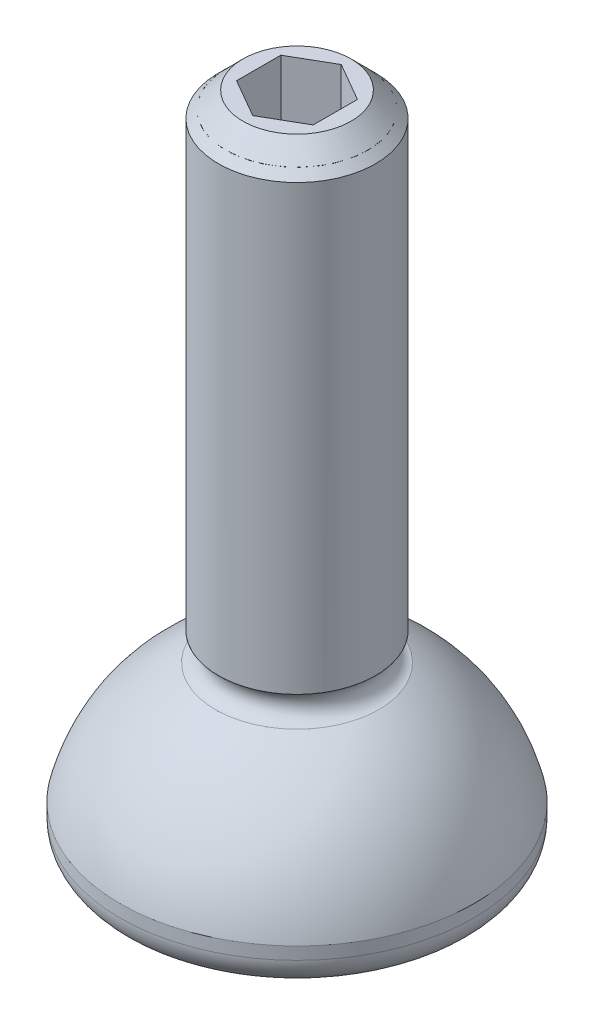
ISO-10303-21;
HEADER;
FILE_DESCRIPTION(('STEP AP214'),'2;1');
FILE_NAME('part.step','',(''),(''),'','','');
FILE_SCHEMA(('AUTOMOTIVE_DESIGN { 1 0 10303 214 1 1 1 1 }'));
ENDSEC;
DATA;
#1=APPLICATION_CONTEXT('core data for automotive mechanical design processes');
#2=APPLICATION_PROTOCOL_DEFINITION('international standard','automotive_design',2000,#1);
#3=PRODUCT_CONTEXT('',#1,'mechanical');
#4=PRODUCT('Part','Part','',(#3));
#5=PRODUCT_RELATED_PRODUCT_CATEGORY('part','',(#4));
#6=PRODUCT_DEFINITION_FORMATION('','',#4);
#7=PRODUCT_DEFINITION_CONTEXT('part definition',#1,'design');
#8=PRODUCT_DEFINITION('design','',#6,#7);
#9=PRODUCT_DEFINITION_SHAPE('','',#8);
#10=(LENGTH_UNIT() NAMED_UNIT(*) SI_UNIT(.MILLI.,.METRE.));
#11=(NAMED_UNIT(*) PLANE_ANGLE_UNIT() SI_UNIT($,.RADIAN.));
#12=(NAMED_UNIT(*) SI_UNIT($,.STERADIAN.) SOLID_ANGLE_UNIT());
#13=UNCERTAINTY_MEASURE_WITH_UNIT(LENGTH_MEASURE(1.E-05),#10,'distance_accuracy_value','');
#14=(GEOMETRIC_REPRESENTATION_CONTEXT(3) GLOBAL_UNCERTAINTY_ASSIGNED_CONTEXT((#13)) GLOBAL_UNIT_ASSIGNED_CONTEXT((#10,
#11,#12)) REPRESENTATION_CONTEXT('',''));
#15=CARTESIAN_POINT('',(0.,0.,0.));
#16=DIRECTION('',(0.,0.,1.));
#17=DIRECTION('',(1.,0.,0.));
#18=AXIS2_PLACEMENT_3D('',#15,#16,#17);
#19=CARTESIAN_POINT('',(0.,18.719800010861,0.));
#20=DIRECTION('',(0.,-1.,0.));
#21=DIRECTION('',(0.,0.,-1.));
#22=AXIS2_PLACEMENT_3D('',#19,#20,#21);
#23=CYLINDRICAL_SURFACE('',#22,1.8288);
#24=CARTESIAN_POINT('',(0.,4.92119226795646,0.));
#25=DIRECTION('',(0.,-1.,0.));
#26=DIRECTION('',(0.,0.,-1.));
#27=AXIS2_PLACEMENT_3D('',#24,#25,#26);
#28=CIRCLE('',#27,1.8288);
#29=CARTESIAN_POINT('',(0.,4.92119226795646,-1.8288));
#30=VERTEX_POINT('',#29);
#31=EDGE_CURVE('P0_E21',#30,#30,#28,.F.);
#32=ORIENTED_EDGE('',*,*,#31,.T.);
#33=EDGE_LOOP('',(#32));
#34=FACE_BOUND('',#33,.T.);
#35=CARTESIAN_POINT('',(0.,16.5862,0.));
#36=DIRECTION('',(0.,-1.,0.));
#37=DIRECTION('',(0.,0.,-1.));
#38=AXIS2_PLACEMENT_3D('',#35,#36,#37);
#39=CIRCLE('',#38,1.8288);
#40=CARTESIAN_POINT('',(0.,16.5862,-1.8288));
#41=VERTEX_POINT('',#40);
#42=EDGE_CURVE('P0_E11',#41,#41,#39,.T.);
#43=ORIENTED_EDGE('',*,*,#42,.T.);
#44=EDGE_LOOP('',(#43));
#45=FACE_BOUND('',#44,.T.);
#46=ADVANCED_FACE('P0_F17',(#34,#45),#23,.T.);
#47=CARTESIAN_POINT('',(0.,4.92119226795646,0.));
#48=DIRECTION('',(0.,-1.,0.));
#49=DIRECTION('',(0.,0.,-1.));
#50=AXIS2_PLACEMENT_3D('',#47,#48,#49);
#51=PLANE('',#50);
#52=ORIENTED_EDGE('',*,*,#31,.F.);
#53=EDGE_LOOP('',(#52));
#54=FACE_BOUND('',#53,.T.);
#55=CARTESIAN_POINT('',(2.032,4.92119226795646,0.));
#56=CARTESIAN_POINT('',(2.03179753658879,4.92119226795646,0.387835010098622));
#57=CARTESIAN_POINT('',(1.88932982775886,4.92119226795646,0.747968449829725));
#58=CARTESIAN_POINT('',(1.73471410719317,4.92119226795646,1.13880993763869));
#59=CARTESIAN_POINT('',(1.43684097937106,4.92119226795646,1.43684097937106));
#60=CARTESIAN_POINT('',(1.13971284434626,4.92119226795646,1.73412663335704));
#61=CARTESIAN_POINT('',(0.747968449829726,4.92119226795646,1.88932982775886));
#62=CARTESIAN_POINT('',(0.38811403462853,4.92119226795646,2.03189869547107));
#63=CARTESIAN_POINT('',(0.,4.92119226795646,2.032));
#64=CARTESIAN_POINT('',(-0.387067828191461,4.92119226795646,2.03210103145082));
#65=CARTESIAN_POINT('',(-0.747968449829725,4.92119226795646,1.88932982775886));
#66=CARTESIAN_POINT('',(-1.13880993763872,4.92119226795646,1.73471410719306));
#67=CARTESIAN_POINT('',(-1.43684097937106,4.92119226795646,1.43684097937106));
#68=CARTESIAN_POINT('',(-1.73412663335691,4.92119226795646,1.13971284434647));
#69=CARTESIAN_POINT('',(-1.88932982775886,4.92119226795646,0.747968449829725));
#70=CARTESIAN_POINT('',(-2.0317972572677,4.92119226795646,0.388370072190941));
#71=CARTESIAN_POINT('',(-2.032,4.92119226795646,0.));
#72=B_SPLINE_CURVE_WITH_KNOTS('',2,(#55,#56,#57,#58,#59,#60,#61,#62,#63,#64,#65,#66,#67,#68,#69,
#70,#71),.UNSPECIFIED.,.F.,.F.,(3,2,2,2,2,2,2,2,3),(0.,0.125,0.25,0.375,0.5,0.625,0.75,0.875,
1.),.UNSPECIFIED.);
#73=CARTESIAN_POINT('',(2.032,4.92119226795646,0.));
#74=VERTEX_POINT('',#73);
#75=CARTESIAN_POINT('',(-2.032,4.92119226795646,0.));
#76=VERTEX_POINT('',#75);
#77=EDGE_CURVE('P0_E29',#74,#76,#72,.T.);
#78=ORIENTED_EDGE('',*,*,#77,.F.);
#79=CARTESIAN_POINT('',(-2.032,4.92119226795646,0.));
#80=CARTESIAN_POINT('',(-2.03179753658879,4.92119226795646,-0.387835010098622));
#81=CARTESIAN_POINT('',(-1.88932982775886,4.92119226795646,-0.747968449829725));
#82=CARTESIAN_POINT('',(-1.73471410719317,4.92119226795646,-1.13880993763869));
#83=CARTESIAN_POINT('',(-1.43684097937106,4.92119226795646,-1.43684097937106));
#84=CARTESIAN_POINT('',(-1.13971284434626,4.92119226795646,-1.73412663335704));
#85=CARTESIAN_POINT('',(-0.747968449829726,4.92119226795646,-1.88932982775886));
#86=CARTESIAN_POINT('',(-0.38811403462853,4.92119226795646,-2.03189869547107));
#87=CARTESIAN_POINT('',(0.,4.92119226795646,-2.032));
#88=CARTESIAN_POINT('',(0.387067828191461,4.92119226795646,-2.03210103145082));
#89=CARTESIAN_POINT('',(0.747968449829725,4.92119226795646,-1.88932982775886));
#90=CARTESIAN_POINT('',(1.13880993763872,4.92119226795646,-1.73471410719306));
#91=CARTESIAN_POINT('',(1.43684097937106,4.92119226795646,-1.43684097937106));
#92=CARTESIAN_POINT('',(1.73412663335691,4.92119226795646,-1.13971284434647));
#93=CARTESIAN_POINT('',(1.88932982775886,4.92119226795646,-0.747968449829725));
#94=CARTESIAN_POINT('',(2.0317972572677,4.92119226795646,-0.388370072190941));
#95=CARTESIAN_POINT('',(2.032,4.92119226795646,0.));
#96=B_SPLINE_CURVE_WITH_KNOTS('',2,(#79,#80,#81,#82,#83,#84,#85,#86,#87,#88,#89,#90,#91,#92,#93,
#94,#95),.UNSPECIFIED.,.F.,.F.,(3,2,2,2,2,2,2,2,3),(0.,0.125,0.25,0.375,0.5,0.625,0.75,0.875,
1.),.UNSPECIFIED.);
#97=EDGE_CURVE('P0_E33',#76,#74,#96,.T.);
#98=ORIENTED_EDGE('',*,*,#97,.F.);
#99=EDGE_LOOP('',(#78,#98));
#100=FACE_BOUND('',#99,.T.);
#101=ADVANCED_FACE('P0_F18',(#54,#100),#51,.F.);
#102=OPEN_SHELL('',(#46,#101));
#103=SHELL_BASED_SURFACE_MODEL('P0_B1',(#102));
#104=CARTESIAN_POINT('',(0.,13.7159999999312,0.));
#105=DIRECTION('',(0.,1.,0.));
#106=DIRECTION('',(0.,0.,1.));
#107=AXIS2_PLACEMENT_3D('',#104,#105,#106);
#108=CONICAL_SURFACE('',#107,0.990599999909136,1.02974425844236);
#109=CARTESIAN_POINT('',(5.6843418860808E-11,13.1207874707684,0.));
#110=VERTEX_POINT('',#109);
#111=VERTEX_LOOP('',#110);
#112=FACE_BOUND('',#111,.T.);
#113=CARTESIAN_POINT('',(0.,13.716,0.));
#114=DIRECTION('',(0.,1.,0.));
#115=DIRECTION('',(0.,0.,1.));
#116=AXIS2_PLACEMENT_3D('',#113,#114,#115);
#117=CIRCLE('',#116,0.9906);
#118=CARTESIAN_POINT('',(0.,13.716,0.9906));
#119=VERTEX_POINT('',#118);
#120=EDGE_CURVE('P1_E133',#119,#119,#117,.T.);
#121=ORIENTED_EDGE('',*,*,#120,.T.);
#122=EDGE_LOOP('',(#121));
#123=FACE_BOUND('',#122,.T.);
#124=ADVANCED_FACE('P1_F17',(#112,#123),#108,.F.);
#125=CARTESIAN_POINT('',(0.,12.9259268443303,0.));
#126=DIRECTION('',(0.,1.,0.));
#127=DIRECTION('',(0.,0.,1.));
#128=AXIS2_PLACEMENT_3D('',#125,#126,#127);
#129=CYLINDRICAL_SURFACE('',#128,0.9906);
#130=ORIENTED_EDGE('',*,*,#120,.F.);
#131=EDGE_LOOP('',(#130));
#132=FACE_BOUND('',#131,.T.);
#133=CARTESIAN_POINT('',(0.,14.986,0.));
#134=DIRECTION('',(0.,1.,0.));
#135=DIRECTION('',(0.,0.,1.));
#136=AXIS2_PLACEMENT_3D('',#133,#134,#135);
#137=CIRCLE('',#136,0.9906);
#138=CARTESIAN_POINT('',(0.9906,14.986,0.));
#139=VERTEX_POINT('',#138);
#140=CARTESIAN_POINT('',(0.495300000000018,14.986,0.857884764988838));
#141=VERTEX_POINT('',#140);
#142=EDGE_CURVE('P1_E123',#139,#141,#137,.F.);
#143=ORIENTED_EDGE('',*,*,#142,.F.);
#144=CARTESIAN_POINT('',(0.,14.986,0.));
#145=DIRECTION('',(0.,1.,0.));
#146=DIRECTION('',(0.,0.,1.));
#147=AXIS2_PLACEMENT_3D('',#144,#145,#146);
#148=CIRCLE('',#147,0.9906);
#149=CARTESIAN_POINT('',(0.495300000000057,14.986,-0.857884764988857));
#150=VERTEX_POINT('',#149);
#151=EDGE_CURVE('P1_E100',#150,#139,#148,.F.);
#152=ORIENTED_EDGE('',*,*,#151,.F.);
#153=CARTESIAN_POINT('',(0.,14.986,0.));
#154=DIRECTION('',(0.,1.,0.));
#155=DIRECTION('',(0.,0.,1.));
#156=AXIS2_PLACEMENT_3D('',#153,#154,#155);
#157=CIRCLE('',#156,0.9906);
#158=CARTESIAN_POINT('',(-0.495300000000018,14.986,-0.857884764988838));
#159=VERTEX_POINT('',#158);
#160=EDGE_CURVE('P1_E93',#159,#150,#157,.F.);
#161=ORIENTED_EDGE('',*,*,#160,.F.);
#162=CARTESIAN_POINT('',(0.,14.986,0.));
#163=DIRECTION('',(0.,1.,0.));
#164=DIRECTION('',(0.,0.,1.));
#165=AXIS2_PLACEMENT_3D('',#162,#163,#164);
#166=CIRCLE('',#165,0.9906);
#167=CARTESIAN_POINT('',(-0.9906,14.986,0.));
#168=VERTEX_POINT('',#167);
#169=EDGE_CURVE('P1_E108',#168,#159,#166,.F.);
#170=ORIENTED_EDGE('',*,*,#169,.F.);
#171=CARTESIAN_POINT('',(0.,14.986,0.));
#172=DIRECTION('',(0.,1.,0.));
#173=DIRECTION('',(0.,0.,1.));
#174=AXIS2_PLACEMENT_3D('',#171,#172,#173);
#175=CIRCLE('',#174,0.9906);
#176=CARTESIAN_POINT('',(-0.495300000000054,14.986,0.857884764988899));
#177=VERTEX_POINT('',#176);
#178=EDGE_CURVE('P1_E138',#177,#168,#175,.F.);
#179=ORIENTED_EDGE('',*,*,#178,.F.);
#180=CARTESIAN_POINT('',(0.,14.986,0.));
#181=DIRECTION('',(0.,1.,0.));
#182=DIRECTION('',(0.,0.,1.));
#183=AXIS2_PLACEMENT_3D('',#180,#181,#182);
#184=CIRCLE('',#183,0.9906);
#185=EDGE_CURVE('P1_E131',#141,#177,#184,.F.);
#186=ORIENTED_EDGE('',*,*,#185,.F.);
#187=EDGE_LOOP('',(#143,#152,#161,#170,#179,#186));
#188=FACE_BOUND('',#187,.T.);
#189=ADVANCED_FACE('P1_F129',(#132,#188),#129,.F.);
#190=CARTESIAN_POINT('',(0.,14.986,0.));
#191=DIRECTION('',(0.,1.,0.));
#192=DIRECTION('',(0.,0.,1.));
#193=AXIS2_PLACEMENT_3D('',#190,#191,#192);
#194=PLANE('',#193);
#195=DIRECTION('',(0.,0.,-1.));
#196=VECTOR('',#195,1.);
#197=CARTESIAN_POINT('',(0.9906,14.986,0.57192317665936));
#198=LINE('',#197,#196);
#199=CARTESIAN_POINT('',(0.990599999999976,14.986,0.571923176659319));
#200=VERTEX_POINT('',#199);
#201=EDGE_CURVE('P1_E115',#200,#139,#198,.T.);
#202=ORIENTED_EDGE('',*,*,#201,.T.);
#203=ORIENTED_EDGE('',*,*,#142,.T.);
#204=DIRECTION('',(0.866025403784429,0.,-0.500000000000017));
#205=VECTOR('',#204,1.);
#206=CARTESIAN_POINT('',(0.,14.986,1.14384635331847));
#207=LINE('',#206,#205);
#208=EDGE_CURVE('P1_E125',#141,#200,#207,.T.);
#209=ORIENTED_EDGE('',*,*,#208,.T.);
#210=EDGE_LOOP('',(#202,#203,#209));
#211=FACE_BOUND('',#210,.T.);
#212=ADVANCED_FACE('P1_F122',(#211),#194,.T.);
#213=CARTESIAN_POINT('',(0.,14.986,0.));
#214=DIRECTION('',(0.,1.,0.));
#215=DIRECTION('',(0.,0.,1.));
#216=AXIS2_PLACEMENT_3D('',#213,#214,#215);
#217=PLANE('',#216);
#218=DIRECTION('',(0.866025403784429,0.,-0.500000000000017));
#219=VECTOR('',#218,1.);
#220=CARTESIAN_POINT('',(0.,14.986,1.14384635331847));
#221=LINE('',#220,#219);
#222=CARTESIAN_POINT('',(0.,14.986,1.14384635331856));
#223=VERTEX_POINT('',#222);
#224=EDGE_CURVE('P1_E311',#223,#141,#221,.T.);
#225=ORIENTED_EDGE('',*,*,#224,.T.);
#226=ORIENTED_EDGE('',*,*,#185,.T.);
#227=DIRECTION('',(0.866025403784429,0.,0.500000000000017));
#228=VECTOR('',#227,1.);
#229=CARTESIAN_POINT('',(-0.9906,14.986,0.57192317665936));
#230=LINE('',#229,#228);
#231=EDGE_CURVE('P1_E325',#177,#223,#230,.T.);
#232=ORIENTED_EDGE('',*,*,#231,.T.);
#233=EDGE_LOOP('',(#225,#226,#232));
#234=FACE_BOUND('',#233,.T.);
#235=ADVANCED_FACE('P1_F194',(#234),#217,.T.);
#236=CARTESIAN_POINT('',(0.,17.018,1.14384635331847));
#237=DIRECTION('',(0.500000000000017,0.,0.866025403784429));
#238=DIRECTION('',(0.866025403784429,0.,-0.500000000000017));
#239=AXIS2_PLACEMENT_3D('',#236,#237,#238);
#240=PLANE('',#239);
#241=ORIENTED_EDGE('',*,*,#208,.F.);
#242=ORIENTED_EDGE('',*,*,#224,.F.);
#243=DIRECTION('',(0.,1.,0.));
#244=VECTOR('',#243,1.);
#245=CARTESIAN_POINT('',(0.,17.018,1.14384635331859));
#246=LINE('',#245,#244);
#247=CARTESIAN_POINT('',(0.,17.018,1.14384635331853));
#248=VERTEX_POINT('',#247);
#249=EDGE_CURVE('P1_E154',#223,#248,#246,.T.);
#250=ORIENTED_EDGE('',*,*,#249,.T.);
#251=DIRECTION('',(0.866025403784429,0.,-0.500000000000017));
#252=VECTOR('',#251,1.);
#253=CARTESIAN_POINT('',(0.,17.018,1.14384635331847));
#254=LINE('',#253,#252);
#255=CARTESIAN_POINT('',(0.990599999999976,17.018,0.571923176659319));
#256=VERTEX_POINT('',#255);
#257=EDGE_CURVE('P1_E135',#256,#248,#254,.F.);
#258=ORIENTED_EDGE('',*,*,#257,.F.);
#259=DIRECTION('',(0.,1.,0.));
#260=VECTOR('',#259,1.);
#261=CARTESIAN_POINT('',(0.9906,17.018,0.57192317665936));
#262=LINE('',#261,#260);
#263=EDGE_CURVE('P1_E127',#256,#200,#262,.F.);
#264=ORIENTED_EDGE('',*,*,#263,.T.);
#265=EDGE_LOOP('',(#241,#242,#250,#258,#264));
#266=FACE_BOUND('',#265,.T.);
#267=ADVANCED_FACE('P1_F191',(#266),#240,.F.);
#268=CARTESIAN_POINT('',(0.9906,17.018,0.57192317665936));
#269=DIRECTION('',(1.,0.,0.));
#270=DIRECTION('',(0.,0.,-1.));
#271=AXIS2_PLACEMENT_3D('',#268,#269,#270);
#272=PLANE('',#271);
#273=DIRECTION('',(0.,0.,1.));
#274=VECTOR('',#273,1.);
#275=CARTESIAN_POINT('',(0.9906,14.986,0.));
#276=LINE('',#275,#274);
#277=CARTESIAN_POINT('',(0.9906,14.986,-0.57192317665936));
#278=VERTEX_POINT('',#277);
#279=EDGE_CURVE('P1_E103',#139,#278,#276,.F.);
#280=ORIENTED_EDGE('',*,*,#279,.F.);
#281=ORIENTED_EDGE('',*,*,#201,.F.);
#282=ORIENTED_EDGE('',*,*,#263,.F.);
#283=DIRECTION('',(0.,0.,-1.));
#284=VECTOR('',#283,1.);
#285=CARTESIAN_POINT('',(0.9906,17.018,0.57192317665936));
#286=LINE('',#285,#284);
#287=CARTESIAN_POINT('',(0.9906,17.018,-0.57192317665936));
#288=VERTEX_POINT('',#287);
#289=EDGE_CURVE('P1_E315',#288,#256,#286,.F.);
#290=ORIENTED_EDGE('',*,*,#289,.F.);
#291=DIRECTION('',(0.,1.,0.));
#292=VECTOR('',#291,1.);
#293=CARTESIAN_POINT('',(0.9906,17.018,-0.57192317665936));
#294=LINE('',#293,#292);
#295=EDGE_CURVE('P1_E117',#288,#278,#294,.F.);
#296=ORIENTED_EDGE('',*,*,#295,.T.);
#297=EDGE_LOOP('',(#280,#281,#282,#290,#296));
#298=FACE_BOUND('',#297,.T.);
#299=ADVANCED_FACE('P1_F113',(#298),#272,.F.);
#300=CARTESIAN_POINT('',(0.,14.986,0.));
#301=DIRECTION('',(0.,1.,0.));
#302=DIRECTION('',(0.,0.,1.));
#303=AXIS2_PLACEMENT_3D('',#300,#301,#302);
#304=PLANE('',#303);
#305=DIRECTION('',(-0.866025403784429,0.,-0.500000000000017));
#306=VECTOR('',#305,1.);
#307=CARTESIAN_POINT('',(0.9906,14.986,-0.57192317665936));
#308=LINE('',#307,#306);
#309=EDGE_CURVE('P1_E105',#278,#150,#308,.T.);
#310=ORIENTED_EDGE('',*,*,#309,.T.);
#311=ORIENTED_EDGE('',*,*,#151,.T.);
#312=ORIENTED_EDGE('',*,*,#279,.T.);
#313=EDGE_LOOP('',(#310,#311,#312));
#314=FACE_BOUND('',#313,.T.);
#315=ADVANCED_FACE('P1_F102',(#314),#304,.T.);
#316=CARTESIAN_POINT('',(0.,14.986,0.));
#317=DIRECTION('',(0.,1.,0.));
#318=DIRECTION('',(0.,0.,1.));
#319=AXIS2_PLACEMENT_3D('',#316,#317,#318);
#320=PLANE('',#319);
#321=DIRECTION('',(0.866025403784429,0.,0.500000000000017));
#322=VECTOR('',#321,1.);
#323=CARTESIAN_POINT('',(-0.9906,14.986,0.57192317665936));
#324=LINE('',#323,#322);
#325=CARTESIAN_POINT('',(-0.9906,14.986,0.57192317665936));
#326=VERTEX_POINT('',#325);
#327=EDGE_CURVE('P1_E307',#326,#177,#324,.T.);
#328=ORIENTED_EDGE('',*,*,#327,.T.);
#329=ORIENTED_EDGE('',*,*,#178,.T.);
#330=DIRECTION('',(0.,0.,1.));
#331=VECTOR('',#330,1.);
#332=CARTESIAN_POINT('',(-0.9906,14.986,-0.57192317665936));
#333=LINE('',#332,#331);
#334=EDGE_CURVE('P1_E272',#168,#326,#333,.T.);
#335=ORIENTED_EDGE('',*,*,#334,.T.);
#336=EDGE_LOOP('',(#328,#329,#335));
#337=FACE_BOUND('',#336,.T.);
#338=ADVANCED_FACE('P1_F182',(#337),#320,.T.);
#339=CARTESIAN_POINT('',(-0.9906,17.018,0.57192317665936));
#340=DIRECTION('',(-0.500000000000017,0.,0.866025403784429));
#341=DIRECTION('',(0.866025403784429,0.,0.500000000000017));
#342=AXIS2_PLACEMENT_3D('',#339,#340,#341);
#343=PLANE('',#342);
#344=ORIENTED_EDGE('',*,*,#231,.F.);
#345=ORIENTED_EDGE('',*,*,#327,.F.);
#346=DIRECTION('',(0.,1.,0.));
#347=VECTOR('',#346,1.);
#348=CARTESIAN_POINT('',(-0.9906,17.018,0.57192317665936));
#349=LINE('',#348,#347);
#350=CARTESIAN_POINT('',(-0.9906,17.018,0.57192317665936));
#351=VERTEX_POINT('',#350);
#352=EDGE_CURVE('P1_E158',#326,#351,#349,.T.);
#353=ORIENTED_EDGE('',*,*,#352,.T.);
#354=DIRECTION('',(0.866025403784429,0.,0.500000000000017));
#355=VECTOR('',#354,1.);
#356=CARTESIAN_POINT('',(-0.9906,17.018,0.57192317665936));
#357=LINE('',#356,#355);
#358=EDGE_CURVE('P1_E118',#248,#351,#357,.F.);
#359=ORIENTED_EDGE('',*,*,#358,.F.);
#360=ORIENTED_EDGE('',*,*,#249,.F.);
#361=EDGE_LOOP('',(#344,#345,#353,#359,#360));
#362=FACE_BOUND('',#361,.T.);
#363=ADVANCED_FACE('P1_F177',(#362),#343,.F.);
#364=CARTESIAN_POINT('',(0.,0.,0.));
#365=DIRECTION('',(0.,-1.,0.));
#366=DIRECTION('',(0.,0.,-1.));
#367=AXIS2_PLACEMENT_3D('',#364,#365,#366);
#368=PLANE('',#367);
#369=CARTESIAN_POINT('',(-3.81,0.,0.));
#370=CARTESIAN_POINT('',(-3.80998123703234,3.42991093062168E-09,0.073703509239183));
#371=CARTESIAN_POINT('',(-3.80784502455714,1.72346642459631E-10,0.147394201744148));
#372=CARTESIAN_POINT('',(-3.80147726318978,7.02951107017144E-11,0.25774609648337));
#373=CARTESIAN_POINT('',(-3.79882721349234,8.33826076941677E-10,0.294501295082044));
#374=CARTESIAN_POINT('',(-3.79247459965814,6.42605942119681E-09,0.367921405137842));
#375=CARTESIAN_POINT('',(-3.78877202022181,1.12548208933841E-08,0.404586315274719));
#376=CARTESIAN_POINT('',(-3.77925788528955,3.0180794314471E-08,0.486947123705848));
#377=CARTESIAN_POINT('',(-3.77315049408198,4.62933987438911E-08,0.532609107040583));
#378=CARTESIAN_POINT('',(-3.75931265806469,1.13142218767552E-07,0.623688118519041));
#379=CARTESIAN_POINT('',(-3.75158213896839,1.63880019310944E-07,0.669105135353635));
#380=CARTESIAN_POINT('',(-3.73276053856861,2.91837082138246E-07,0.768623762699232));
#381=CARTESIAN_POINT('',(-3.72130690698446,3.72315447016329E-07,0.822657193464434));
#382=CARTESIAN_POINT('',(-3.69176373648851,4.65061966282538E-07,0.948070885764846));
#383=CARTESIAN_POINT('',(-3.6727347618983,4.45662604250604E-07,1.01923143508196));
#384=CARTESIAN_POINT('',(-3.63048272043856,2.95360458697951E-07,1.16029156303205));
#385=CARTESIAN_POINT('',(-3.60726003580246,1.64467833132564E-07,1.23019125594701));
#386=CARTESIAN_POINT('',(-3.56931623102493,3.32022337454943E-08,1.33389012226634));
#387=CARTESIAN_POINT('',(-3.55615011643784,2.92593406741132E-10,1.36826436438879));
#388=CARTESIAN_POINT('',(-3.52783444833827,-3.14067370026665E-10,1.43912559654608));
#389=CARTESIAN_POINT('',(-3.51261024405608,3.69522483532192E-08,1.47558249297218));
#390=CARTESIAN_POINT('',(-3.46154955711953,8.87913796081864E-08,1.59338906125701));
#391=CARTESIAN_POINT('',(-3.42372882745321,1.68133213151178E-08,1.67390861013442));
#392=CARTESIAN_POINT('',(-3.36574740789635,-4.71554108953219E-09,1.78600873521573));
#393=CARTESIAN_POINT('',(-3.34806551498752,-1.05884212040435E-09,1.8188892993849));
#394=CARTESIAN_POINT('',(-3.28570781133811,5.72589693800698E-09,1.93092505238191));
#395=CARTESIAN_POINT('',(-3.23869089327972,5.7269457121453E-10,2.00880790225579));
#396=CARTESIAN_POINT('',(-3.17791849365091,-1.27052633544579E-10,2.10174339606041));
#397=CARTESIAN_POINT('',(-3.16675016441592,-2.86632626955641E-11,2.11852797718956));
#398=CARTESIAN_POINT('',(-3.13284839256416,1.7743604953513E-10,2.16861389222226));
#399=CARTESIAN_POINT('',(-3.10971743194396,1.96089962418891E-10,2.20164855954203));
#400=CARTESIAN_POINT('',(-3.0624203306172,3.04385653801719E-10,2.26696646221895));
#401=CARTESIAN_POINT('',(-3.03825419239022,3.94027262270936E-10,2.29924969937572));
#402=CARTESIAN_POINT('',(-2.98891057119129,4.95707369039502E-10,2.36303421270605));
#403=CARTESIAN_POINT('',(-2.96373308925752,5.07745946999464E-10,2.39453548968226));
#404=CARTESIAN_POINT('',(-2.91239218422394,4.73186613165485E-10,2.45672398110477));
#405=CARTESIAN_POINT('',(-2.88622876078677,4.26588681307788E-10,2.48741119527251));
#406=CARTESIAN_POINT('',(-2.83294215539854,2.94096435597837E-10,2.54794080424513));
#407=CARTESIAN_POINT('',(-2.80581897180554,2.08202054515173E-10,2.57778319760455));
#408=CARTESIAN_POINT('',(-2.75064026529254,6.09424512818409E-11,2.63659349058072));
#409=CARTESIAN_POINT('',(-2.72258473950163,-4.22695329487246E-13,2.66556138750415));
#410=CARTESIAN_POINT('',(-2.66698223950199,4.01739807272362E-13,2.72117860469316));
#411=CARTESIAN_POINT('',(-2.63947900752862,5.66168003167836E-11,2.74787167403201));
#412=CARTESIAN_POINT('',(-2.58367669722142,2.57306698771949E-10,2.80041778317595));
#413=CARTESIAN_POINT('',(-2.55537754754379,4.01789472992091E-10,2.82627074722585));
#414=CARTESIAN_POINT('',(-2.49800929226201,7.55440233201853E-10,2.87711303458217));
#415=CARTESIAN_POINT('',(-2.46894011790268,9.64614013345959E-10,2.90210228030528));
#416=CARTESIAN_POINT('',(-2.41005803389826,1.42668041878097E-09,2.95119406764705));
#417=CARTESIAN_POINT('',(-2.3802450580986,1.67957694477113E-09,2.97529652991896));
#418=CARTESIAN_POINT('',(-2.3199023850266,2.20997075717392E-09,3.02259254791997));
#419=CARTESIAN_POINT('',(-2.28937262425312,2.48747022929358E-09,3.04578602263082));
#420=CARTESIAN_POINT('',(-2.22762403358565,3.0500036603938E-09,3.09124266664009));
#421=CARTESIAN_POINT('',(-2.19640514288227,3.33503828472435E-09,3.11350575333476));
#422=CARTESIAN_POINT('',(-2.13330659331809,3.89757303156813E-09,3.15708106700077));
#423=CARTESIAN_POINT('',(-2.10142687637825,4.17507248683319E-09,3.17839320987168));
#424=CARTESIAN_POINT('',(-2.03703558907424,4.70948018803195E-09,3.22004693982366));
#425=CARTESIAN_POINT('',(-2.00452396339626,4.96638662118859E-09,3.24038844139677));
#426=CARTESIAN_POINT('',(-1.93889836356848,5.44855906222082E-09,3.28008207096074));
#427=CARTESIAN_POINT('',(-1.90578433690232,5.67382229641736E-09,3.29943411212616));
#428=CARTESIAN_POINT('',(-1.83898400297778,6.08366883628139E-09,3.33713089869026));
#429=CARTESIAN_POINT('',(-1.80529764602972,6.26824859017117E-09,3.35547555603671));
#430=CARTESIAN_POINT('',(-1.73738325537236,6.58969689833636E-09,3.39114056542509));
#431=CARTESIAN_POINT('',(-1.70315517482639,6.72656130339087E-09,3.40846082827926));
#432=CARTESIAN_POINT('',(-1.6341884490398,6.94755698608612E-09,3.44206096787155));
#433=CARTESIAN_POINT('',(-1.59944975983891,7.03168369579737E-09,3.45834075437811));
#434=CARTESIAN_POINT('',(-1.52949340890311,7.14419061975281E-09,3.4898448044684));
#435=CARTESIAN_POINT('',(-1.49427570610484,7.17256602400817E-09,3.50506897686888));
#436=CARTESIAN_POINT('',(-1.42339337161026,7.17256604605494E-09,3.53444762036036));
#437=CARTESIAN_POINT('',(-1.387728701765,7.14418578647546E-09,3.54860199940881));
#438=CARTESIAN_POINT('',(-1.3159848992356,7.03167886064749E-09,3.57582784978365));
#439=CARTESIAN_POINT('',(-1.27990573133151,6.94754742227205E-09,3.58889922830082));
#440=CARTESIAN_POINT('',(-1.20736579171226,6.72655187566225E-09,3.61394685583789));
#441=CARTESIAN_POINT('',(-1.17090498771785,6.58968327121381E-09,3.62592301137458));
#442=CARTESIAN_POINT('',(-1.09763499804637,6.26823459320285E-09,3.64876896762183));
#443=CARTESIAN_POINT('',(-1.06082578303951,6.08365046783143E-09,3.65963867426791));
#444=CARTESIAN_POINT('',(-0.986892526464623,5.67380544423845E-09,3.68026151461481));
#445=CARTESIAN_POINT('',(-0.949768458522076,5.44854110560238E-09,3.69001455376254));
#446=CARTESIAN_POINT('',(-0.875239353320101,4.96636314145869E-09,3.70839485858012));
#447=CARTESIAN_POINT('',(-0.837834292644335,4.70944685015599E-09,3.71702202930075));
#448=CARTESIAN_POINT('',(-0.762777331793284,4.175059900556E-09,3.73314242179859));
#449=CARTESIAN_POINT('',(-0.725125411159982,3.8975875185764E-09,3.74063554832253));
#450=CARTESIAN_POINT('',(-0.649609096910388,3.33497545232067E-09,3.75448071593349));
#451=CARTESIAN_POINT('',(-0.611744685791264,3.04983512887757E-09,3.76083266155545));
#452=CARTESIAN_POINT('',(-0.535837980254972,2.48759043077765E-09,3.77238935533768));
#453=CARTESIAN_POINT('',(-0.497795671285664,2.21048672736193E-09,3.77759400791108));
#454=CARTESIAN_POINT('',(-0.421567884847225,1.67901534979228E-09,3.78685111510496));
#455=CARTESIAN_POINT('',(-0.3833823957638,1.42464956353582E-09,3.79090347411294));
#456=CARTESIAN_POINT('',(-0.30690330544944,9.66605326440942E-10,3.79785180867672));
#457=CARTESIAN_POINT('',(-0.268609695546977,7.62931065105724E-10,3.80074768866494));
#458=CARTESIAN_POINT('',(-0.191948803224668,3.94267631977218E-10,3.8053808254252));
#459=CARTESIAN_POINT('',(-0.153581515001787,2.29281644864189E-10,3.80711798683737));
#460=CARTESIAN_POINT('',(-0.0768105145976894,8.46269037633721E-11,3.80942919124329));
#461=CARTESIAN_POINT('',(-0.038406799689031,1.0497333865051E-10,3.81000313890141));
#462=CARTESIAN_POINT('',(0.0736767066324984,-2.01372932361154E-10,3.80999397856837));
#463=CARTESIAN_POINT('',(0.147364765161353,-8.63918755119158E-10,3.80786429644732));
#464=CARTESIAN_POINT('',(0.25770050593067,1.71867497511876E-09,3.801506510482));
#465=CARTESIAN_POINT('',(0.294448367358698,3.17578591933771E-09,3.7988598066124));
#466=CARTESIAN_POINT('',(0.367854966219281,1.11533598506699E-08,3.79251288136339));
#467=CARTESIAN_POINT('',(0.404513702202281,1.76739046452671E-08,3.78881264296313));
#468=CARTESIAN_POINT('',(0.486860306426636,4.07644787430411E-08,3.77930304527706));
#469=CARTESIAN_POINT('',(0.532514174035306,5.94394273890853E-08,3.77319766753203));
#470=CARTESIAN_POINT('',(0.623576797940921,1.30823086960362E-07,3.75936231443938));
#471=CARTESIAN_POINT('',(0.668985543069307,1.83533335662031E-07,3.75163226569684));
#472=CARTESIAN_POINT('',(0.768506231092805,3.12540479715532E-07,3.732807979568));
#473=CARTESIAN_POINT('',(0.822549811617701,3.91444311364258E-07,3.72135032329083));
#474=CARTESIAN_POINT('',(0.947986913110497,4.78946219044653E-07,3.69179805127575));
#475=CARTESIAN_POINT('',(1.01916071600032,4.55353867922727E-07,3.6727640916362));
#476=CARTESIAN_POINT('',(1.16024694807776,2.98807501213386E-07,3.63050165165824));
#477=CARTESIAN_POINT('',(1.23015949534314,1.6586377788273E-07,3.60727356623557));
#478=CARTESIAN_POINT('',(1.33387748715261,3.33197639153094E-08,3.5693217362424));
#479=CARTESIAN_POINT('',(1.36825805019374,2.83684274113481E-10,3.55615297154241));
#480=CARTESIAN_POINT('',(1.43912551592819,-3.04447463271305E-10,3.52783412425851));
#481=CARTESIAN_POINT('',(1.47558240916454,3.71133268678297E-08,3.51260957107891));
#482=CARTESIAN_POINT('',(1.59338864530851,8.8999409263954E-08,3.4615496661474));
#483=CARTESIAN_POINT('',(1.67390746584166,1.63604830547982E-08,3.42373246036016));
#484=CARTESIAN_POINT('',(1.78600901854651,-4.5252902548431E-09,3.3657459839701));
#485=CARTESIAN_POINT('',(1.8188901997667,-4.81958879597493E-10,3.34806141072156));
#486=CARTESIAN_POINT('',(1.88528513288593,2.36486148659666E-09,3.31111415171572));
#487=CARTESIAN_POINT('',(1.91878014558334,9.78031825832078E-10,3.29181777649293));
#488=CARTESIAN_POINT('',(1.99683569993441,-5.9296222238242E-10,3.24524458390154));
#489=CARTESIAN_POINT('',(2.04114626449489,-1.82847368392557E-10,3.21754725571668));
#490=CARTESIAN_POINT('',(2.12705168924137,1.76405616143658E-10,3.16136592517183));
#491=CARTESIAN_POINT('',(2.16868722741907,1.41275034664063E-10,3.13294401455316));
#492=CARTESIAN_POINT('',(2.25079986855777,2.41901573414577E-10,3.07447195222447));
#493=CARTESIAN_POINT('',(2.2912769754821,3.77658108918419E-10,3.04442180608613));
#494=CARTESIAN_POINT('',(2.36303468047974,4.98635925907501E-10,2.98891026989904));
#495=CARTESIAN_POINT('',(2.39453562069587,5.0853228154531E-10,2.96373300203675));
#496=CARTESIAN_POINT('',(2.45672385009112,4.72400278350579E-10,2.91239227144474));
#497=CARTESIAN_POINT('',(2.48741113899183,4.26371900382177E-10,2.88622880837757));
#498=CARTESIAN_POINT('',(2.54794086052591,2.94313216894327E-10,2.83294210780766));
#499=CARTESIAN_POINT('',(2.57778329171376,2.08282842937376E-10,2.80581886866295));
#500=CARTESIAN_POINT('',(2.63659339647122,6.08616626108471E-11,2.75064036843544));
#501=CARTESIAN_POINT('',(2.66556106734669,-5.29067879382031E-13,2.7225851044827));
#502=CARTESIAN_POINT('',(2.72913585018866,6.50468101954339E-13,2.65902704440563));
#503=CARTESIAN_POINT('',(2.76351178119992,9.48972512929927E-11,2.6232925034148));
#504=CARTESIAN_POINT('',(2.83022040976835,4.36113483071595E-10,2.55118081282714));
#505=CARTESIAN_POINT('',(2.86257910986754,6.80231798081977E-10,2.51482770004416));
#506=CARTESIAN_POINT('',(2.92528479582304,1.27961850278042E-09,2.44160349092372));
#507=CARTESIAN_POINT('',(2.95565817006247,1.63271023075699E-09,2.40475499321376));
#508=CARTESIAN_POINT('',(3.01442934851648,2.41305139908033E-09,2.33065926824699));
#509=CARTESIAN_POINT('',(3.04285386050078,2.83874969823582E-09,2.29343322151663));
#510=CARTESIAN_POINT('',(3.09776893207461,3.73066423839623E-09,2.21869588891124));
#511=CARTESIAN_POINT('',(3.12428643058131,4.19592606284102E-09,2.18120439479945));
#512=CARTESIAN_POINT('',(3.17543366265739,5.13700341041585E-09,2.10604390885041));
#513=CARTESIAN_POINT('',(3.20009048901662,5.61242370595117E-09,2.06839335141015));
#514=CARTESIAN_POINT('',(3.24756671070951,6.547448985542E-09,1.99301668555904));
#515=CARTESIAN_POINT('',(3.27041327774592,7.00717896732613E-09,1.95530768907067));
#516=CARTESIAN_POINT('',(3.31432293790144,7.88807437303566E-09,1.8799103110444));
#517=CARTESIAN_POINT('',(3.33541321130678,8.30984230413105E-09,1.84223775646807));
#518=CARTESIAN_POINT('',(3.37586739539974,9.09568201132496E-09,1.76700367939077));
#519=CARTESIAN_POINT('',(3.39525842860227,9.46078750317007E-09,1.72945673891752));
#520=CARTESIAN_POINT('',(3.43237393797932,1.01177954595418E-08,1.6545586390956));
#521=CARTESIAN_POINT('',(3.45012541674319,1.04111123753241E-08,1.61722085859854));
#522=CARTESIAN_POINT('',(3.48402390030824,1.09126565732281E-08,1.542820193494));
#523=CARTESIAN_POINT('',(3.50019772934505,1.11226241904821E-08,1.50576952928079));
#524=CARTESIAN_POINT('',(3.53100481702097,1.14492403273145E-08,1.43201688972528));
#525=CARTESIAN_POINT('',(3.5456646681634,1.1567894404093E-08,1.39532601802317));
#526=CARTESIAN_POINT('',(3.57350931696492,1.17072011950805E-08,1.32236084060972));
#527=CARTESIAN_POINT('',(3.58672042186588,1.17300609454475E-08,1.28609658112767));
#528=CARTESIAN_POINT('',(3.61173371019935,1.16770641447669E-08,1.21404935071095));
#529=CARTESIAN_POINT('',(3.62356188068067,1.16035363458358E-08,1.17827536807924));
#530=CARTESIAN_POINT('',(3.65662216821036,1.1242058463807E-08,1.07307095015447));
#531=CARTESIAN_POINT('',(3.67640858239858,1.08185305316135E-08,1.00317966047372));
#532=CARTESIAN_POINT('',(3.71105555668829,9.63864536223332E-09,0.865935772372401));
#533=CARTESIAN_POINT('',(3.72611419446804,8.90014819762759E-09,0.798632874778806));
#534=CARTESIAN_POINT('',(3.75185339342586,7.21278406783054E-09,0.666901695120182));
#535=CARTESIAN_POINT('',(3.7627239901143,6.27717200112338E-09,0.602510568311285));
#536=CARTESIAN_POINT('',(3.78062248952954,4.3916114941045E-09,0.476880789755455));
#537=CARTESIAN_POINT('',(3.78783172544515,3.44541053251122E-09,0.415667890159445));
#538=CARTESIAN_POINT('',(3.79893251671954,1.75224676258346E-09,0.296609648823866));
#539=CARTESIAN_POINT('',(3.80299576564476,9.96785624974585E-10,0.238780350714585));
#540=CARTESIAN_POINT('',(3.80759515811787,2.29923184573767E-10,0.14147808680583));
#541=CARTESIAN_POINT('',(3.80884313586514,5.79962007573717E-11,0.10203755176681));
#542=CARTESIAN_POINT('',(3.80982608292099,-3.06292758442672E-11,0.0417268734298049));
#543=CARTESIAN_POINT('',(3.80999689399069,-2.94185775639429E-11,0.0208633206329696));
#544=CARTESIAN_POINT('',(3.81,0.,0.));
#545=B_SPLINE_CURVE_WITH_KNOTS('',3,(#369,#370,#371,#372,#373,#374,#375,#376,#377,#378,#379,
#380,#381,#382,#383,#384,#385,#386,#387,#388,#389,#390,#391,#392,#393,#394,#395,#396,#397,#398,
#399,#400,#401,#402,#403,#404,#405,#406,#407,#408,#409,#410,#411,#412,#413,#414,#415,#416,#417,
#418,#419,#420,#421,#422,#423,#424,#425,#426,#427,#428,#429,#430,#431,#432,#433,#434,#435,#436,
#437,#438,#439,#440,#441,#442,#443,#444,#445,#446,#447,#448,#449,#450,#451,#452,#453,#454,#455,
#456,#457,#458,#459,#460,#461,#462,#463,#464,#465,#466,#467,#468,#469,#470,#471,#472,#473,#474,
#475,#476,#477,#478,#479,#480,#481,#482,#483,#484,#485,#486,#487,#488,#489,#490,#491,#492,#493,
#494,#495,#496,#497,#498,#499,#500,#501,#502,#503,#504,#505,#506,#507,#508,#509,#510,#511,#512,
#513,#514,#515,#516,#517,#518,#519,#520,#521,#522,#523,#524,#525,#526,#527,#528,#529,#530,#531,
#532,#533,#534,#535,#536,#537,#538,#539,#540,#541,#542,#543,#544),.UNSPECIFIED.,.F.,.F.,(4,2,2,
2,2,2,2,2,2,2,2,2,2,2,2,2,2,2,2,2,2,2,2,2,2,2,2,2,2,2,2,2,2,2,2,2,2,2,2,2,2,2,2,2,2,2,2,2,2,2,2,
2,2,2,2,2,2,2,2,2,2,2,2,2,2,2,2,2,2,2,2,2,2,2,2,2,2,2,2,2,2,2,2,2,2,2,2,4),(0.,
0.221052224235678,0.331589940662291,0.442129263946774,0.580304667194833,0.718486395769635,
0.884134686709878,1.10498376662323,1.32581272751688,1.43622545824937,1.55474158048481,
1.82135720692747,1.93334872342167,2.20597338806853,2.26645533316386,2.38741510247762,
2.50837458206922,2.62933393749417,2.750293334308,2.87125293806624,2.99221291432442,
3.1071761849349,3.22214979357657,3.33713370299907,3.45212787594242,3.567132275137,
3.68214686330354,3.79717160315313,3.91220645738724,4.02725138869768,4.14230635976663,
4.25737133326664,4.3724462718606,4.48753113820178,4.60262589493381,4.71773050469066,
4.83284493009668,4.94796913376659,5.06310307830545,5.17824672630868,5.29340004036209,
5.40856298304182,5.52373551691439,5.63891760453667,5.7541092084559,5.86931029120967,
5.98452081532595,6.20553199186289,6.31604967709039,6.42656914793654,6.56471982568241,
6.70287674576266,6.86855733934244,7.0894487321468,7.31031933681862,7.42075270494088,
7.53926882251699,7.80588443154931,7.91787527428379,8.03382575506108,8.19054329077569,
8.34173963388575,8.49293545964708,8.61389481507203,8.73485421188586,8.8558138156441,
8.97677379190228,9.12548931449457,9.27145978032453,9.41468508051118,9.55516511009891,
9.69289976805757,9.82788895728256,9.96013258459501,10.0896305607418,10.2163828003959,
10.3403892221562,10.461649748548,10.5801643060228,10.6959328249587,10.8089552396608,
11.0267392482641,11.2335413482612,11.4293608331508,11.6141970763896,11.7880495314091,
11.9064118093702,11.969001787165),.UNSPECIFIED.);
#546=CARTESIAN_POINT('',(-3.81,0.,0.));
#547=VERTEX_POINT('',#546);
#548=CARTESIAN_POINT('',(3.81,0.,0.));
#549=VERTEX_POINT('',#548);
#550=EDGE_CURVE('P1_E146',#547,#549,#545,.T.);
#551=ORIENTED_EDGE('',*,*,#550,.F.);
#552=CARTESIAN_POINT('',(0.,0.,0.));
#553=DIRECTION('',(0.,1.,0.));
#554=DIRECTION('',(1.,0.,0.));
#555=AXIS2_PLACEMENT_3D('',#552,#553,#554);
#556=CIRCLE('',#555,3.81);
#557=EDGE_CURVE('P1_E150',#549,#547,#556,.T.);
#558=ORIENTED_EDGE('',*,*,#557,.F.);
#559=EDGE_LOOP('',(#551,#558));
#560=FACE_BOUND('',#559,.T.);
#561=ADVANCED_FACE('P1_F156',(#560),#368,.T.);
#562=CARTESIAN_POINT('',(0.9906,17.018,-0.57192317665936));
#563=DIRECTION('',(0.500000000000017,0.,-0.866025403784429));
#564=DIRECTION('',(-0.866025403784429,0.,-0.500000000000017));
#565=AXIS2_PLACEMENT_3D('',#562,#563,#564);
#566=PLANE('',#565);
#567=DIRECTION('',(-0.866025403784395,0.,-0.500000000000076));
#568=VECTOR('',#567,1.);
#569=CARTESIAN_POINT('',(0.4953,14.986,-0.857884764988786));
#570=LINE('',#569,#568);
#571=CARTESIAN_POINT('',(0.,14.986,-1.14384635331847));
#572=VERTEX_POINT('',#571);
#573=EDGE_CURVE('P1_E260',#150,#572,#570,.T.);
#574=ORIENTED_EDGE('',*,*,#573,.F.);
#575=ORIENTED_EDGE('',*,*,#309,.F.);
#576=ORIENTED_EDGE('',*,*,#295,.F.);
#577=DIRECTION('',(-0.866025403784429,0.,-0.500000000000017));
#578=VECTOR('',#577,1.);
#579=CARTESIAN_POINT('',(0.9906,17.018,-0.57192317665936));
#580=LINE('',#579,#578);
#581=CARTESIAN_POINT('',(0.,17.018,-1.14384635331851));
#582=VERTEX_POINT('',#581);
#583=EDGE_CURVE('P1_E37',#582,#288,#580,.F.);
#584=ORIENTED_EDGE('',*,*,#583,.F.);
#585=DIRECTION('',(0.,1.,0.));
#586=VECTOR('',#585,1.);
#587=CARTESIAN_POINT('',(0.,17.018,-1.14384635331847));
#588=LINE('',#587,#586);
#589=EDGE_CURVE('P1_E157',#582,#572,#588,.F.);
#590=ORIENTED_EDGE('',*,*,#589,.T.);
#591=EDGE_LOOP('',(#574,#575,#576,#584,#590));
#592=FACE_BOUND('',#591,.T.);
#593=ADVANCED_FACE('P1_F176',(#592),#566,.F.);
#594=CARTESIAN_POINT('',(0.,14.986,0.));
#595=DIRECTION('',(0.,1.,0.));
#596=DIRECTION('',(0.,0.,1.));
#597=AXIS2_PLACEMENT_3D('',#594,#595,#596);
#598=PLANE('',#597);
#599=DIRECTION('',(-0.866025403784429,0.,0.500000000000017));
#600=VECTOR('',#599,1.);
#601=CARTESIAN_POINT('',(0.,14.986,-1.14384635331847));
#602=LINE('',#601,#600);
#603=EDGE_CURVE('P1_E261',#572,#159,#602,.T.);
#604=ORIENTED_EDGE('',*,*,#603,.T.);
#605=ORIENTED_EDGE('',*,*,#160,.T.);
#606=ORIENTED_EDGE('',*,*,#573,.T.);
#607=EDGE_LOOP('',(#604,#605,#606));
#608=FACE_BOUND('',#607,.T.);
#609=ADVANCED_FACE('P1_F374',(#608),#598,.T.);
#610=CARTESIAN_POINT('',(0.,14.986,0.));
#611=DIRECTION('',(0.,1.,0.));
#612=DIRECTION('',(0.,0.,1.));
#613=AXIS2_PLACEMENT_3D('',#610,#611,#612);
#614=PLANE('',#613);
#615=DIRECTION('',(0.,0.,1.));
#616=VECTOR('',#615,1.);
#617=CARTESIAN_POINT('',(-0.9906,14.986,-0.57192317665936));
#618=LINE('',#617,#616);
#619=CARTESIAN_POINT('',(-0.990599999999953,14.986,-0.571923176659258));
#620=VERTEX_POINT('',#619);
#621=EDGE_CURVE('P1_E259',#620,#168,#618,.T.);
#622=ORIENTED_EDGE('',*,*,#621,.T.);
#623=ORIENTED_EDGE('',*,*,#169,.T.);
#624=DIRECTION('',(-0.866025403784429,0.,0.500000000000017));
#625=VECTOR('',#624,1.);
#626=CARTESIAN_POINT('',(0.,14.986,-1.14384635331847));
#627=LINE('',#626,#625);
#628=EDGE_CURVE('P1_E263',#159,#620,#627,.T.);
#629=ORIENTED_EDGE('',*,*,#628,.T.);
#630=EDGE_LOOP('',(#622,#623,#629));
#631=FACE_BOUND('',#630,.T.);
#632=ADVANCED_FACE('P1_F377',(#631),#614,.T.);
#633=CARTESIAN_POINT('',(-0.9906,17.018,-0.57192317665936));
#634=DIRECTION('',(-1.,0.,0.));
#635=DIRECTION('',(0.,0.,1.));
#636=AXIS2_PLACEMENT_3D('',#633,#634,#635);
#637=PLANE('',#636);
#638=ORIENTED_EDGE('',*,*,#334,.F.);
#639=ORIENTED_EDGE('',*,*,#621,.F.);
#640=DIRECTION('',(0.,1.,0.));
#641=VECTOR('',#640,1.);
#642=CARTESIAN_POINT('',(-0.99059999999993,17.018,-0.571923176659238));
#643=LINE('',#642,#641);
#644=CARTESIAN_POINT('',(-0.990599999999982,17.018,-0.571923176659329));
#645=VERTEX_POINT('',#644);
#646=EDGE_CURVE('P1_E256',#620,#645,#643,.T.);
#647=ORIENTED_EDGE('',*,*,#646,.T.);
#648=DIRECTION('',(0.,0.,1.));
#649=VECTOR('',#648,1.);
#650=CARTESIAN_POINT('',(-0.9906,17.018,-0.57192317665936));
#651=LINE('',#650,#649);
#652=EDGE_CURVE('P1_E257',#351,#645,#651,.F.);
#653=ORIENTED_EDGE('',*,*,#652,.F.);
#654=ORIENTED_EDGE('',*,*,#352,.F.);
#655=EDGE_LOOP('',(#638,#639,#647,#653,#654));
#656=FACE_BOUND('',#655,.T.);
#657=ADVANCED_FACE('P1_F247',(#656),#637,.F.);
#658=CARTESIAN_POINT('',(0.,0.762,0.));
#659=DIRECTION('',(0.,-1.,0.));
#660=DIRECTION('',(0.999865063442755,0.,0.0164272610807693));
#661=AXIS2_PLACEMENT_3D('',#658,#659,#660);
#662=TOROIDAL_SURFACE('',#661,3.81,0.762);
#663=ORIENTED_EDGE('',*,*,#550,.T.);
#664=ORIENTED_EDGE('',*,*,#557,.T.);
#665=EDGE_LOOP('',(#663,#664));
#666=FACE_BOUND('',#665,.T.);
#667=CARTESIAN_POINT('',(0.,0.762,0.));
#668=DIRECTION('',(0.,-1.,0.));
#669=DIRECTION('',(0.,0.,-1.));
#670=AXIS2_PLACEMENT_3D('',#667,#668,#669);
#671=CIRCLE('',#670,4.572);
#672=CARTESIAN_POINT('',(0.,0.762,-4.572));
#673=VERTEX_POINT('',#672);
#674=EDGE_CURVE('P1_E252',#673,#673,#671,.F.);
#675=ORIENTED_EDGE('',*,*,#674,.F.);
#676=EDGE_LOOP('',(#675));
#677=FACE_BOUND('',#676,.T.);
#678=ADVANCED_FACE('P1_F148',(#666,#677),#662,.T.);
#679=CARTESIAN_POINT('',(0.,17.018,-1.14384635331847));
#680=DIRECTION('',(-0.500000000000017,0.,-0.866025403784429));
#681=DIRECTION('',(-0.866025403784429,0.,0.500000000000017));
#682=AXIS2_PLACEMENT_3D('',#679,#680,#681);
#683=PLANE('',#682);
#684=ORIENTED_EDGE('',*,*,#628,.F.);
#685=ORIENTED_EDGE('',*,*,#603,.F.);
#686=ORIENTED_EDGE('',*,*,#589,.F.);
#687=DIRECTION('',(-0.866025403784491,0.,0.49999999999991));
#688=VECTOR('',#687,1.);
#689=CARTESIAN_POINT('',(0.,17.018,-1.14384635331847));
#690=LINE('',#689,#688);
#691=EDGE_CURVE('P1_E255',#582,#645,#690,.T.);
#692=ORIENTED_EDGE('',*,*,#691,.T.);
#693=ORIENTED_EDGE('',*,*,#646,.F.);
#694=EDGE_LOOP('',(#684,#685,#686,#692,#693));
#695=FACE_BOUND('',#694,.T.);
#696=ADVANCED_FACE('P1_F239',(#695),#683,.F.);
#697=CARTESIAN_POINT('',(0.,0.,0.));
#698=DIRECTION('',(0.,-1.,0.));
#699=DIRECTION('',(0.,0.,-1.));
#700=AXIS2_PLACEMENT_3D('',#697,#698,#699);
#701=CYLINDRICAL_SURFACE('',#700,4.572);
#702=CARTESIAN_POINT('',(0.,1.08508847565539,0.));
#703=DIRECTION('',(0.,-1.,0.));
#704=DIRECTION('',(0.,0.,-1.));
#705=AXIS2_PLACEMENT_3D('',#702,#703,#704);
#706=CIRCLE('',#705,4.572);
#707=CARTESIAN_POINT('',(0.,1.08508847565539,-4.572));
#708=VERTEX_POINT('',#707);
#709=EDGE_CURVE('P1_E290',#708,#708,#706,.F.);
#710=ORIENTED_EDGE('',*,*,#709,.F.);
#711=EDGE_LOOP('',(#710));
#712=FACE_BOUND('',#711,.T.);
#713=ORIENTED_EDGE('',*,*,#674,.T.);
#714=EDGE_LOOP('',(#713));
#715=FACE_BOUND('',#714,.T.);
#716=ADVANCED_FACE('P1_F235',(#712,#715),#701,.T.);
#717=CARTESIAN_POINT('',(0.,17.018,0.));
#718=DIRECTION('',(0.,-1.,0.));
#719=DIRECTION('',(0.,0.,-1.));
#720=AXIS2_PLACEMENT_3D('',#717,#718,#719);
#721=PLANE('',#720);
#722=ORIENTED_EDGE('',*,*,#583,.T.);
#723=ORIENTED_EDGE('',*,*,#289,.T.);
#724=ORIENTED_EDGE('',*,*,#257,.T.);
#725=ORIENTED_EDGE('',*,*,#358,.T.);
#726=ORIENTED_EDGE('',*,*,#652,.T.);
#727=ORIENTED_EDGE('',*,*,#691,.F.);
#728=EDGE_LOOP('',(#722,#723,#724,#725,#726,#727));
#729=FACE_BOUND('',#728,.T.);
#730=CARTESIAN_POINT('',(0.,17.0180000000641,0.));
#731=DIRECTION('',(0.,-1.,0.));
#732=DIRECTION('',(0.,0.,-1.));
#733=AXIS2_PLACEMENT_3D('',#730,#731,#732);
#734=CIRCLE('',#733,1.39699999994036);
#735=CARTESIAN_POINT('',(0.,17.0180000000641,-1.39699999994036));
#736=VERTEX_POINT('',#735);
#737=EDGE_CURVE('P1_E295',#736,#736,#734,.T.);
#738=ORIENTED_EDGE('',*,*,#737,.F.);
#739=EDGE_LOOP('',(#738));
#740=FACE_BOUND('',#739,.T.);
#741=ADVANCED_FACE('P1_F231',(#729,#740),#721,.F.);
#742=CARTESIAN_POINT('',(0.,0.,0.));
#743=DIRECTION('',(-1.,0.,0.));
#744=DIRECTION('',(0.,0.,-1.));
#745=AXIS2_PLACEMENT_3D('',#742,#743,#744);
#746=SPHERICAL_SURFACE('',#745,4.699);
#747=ORIENTED_EDGE('',*,*,#709,.T.);
#748=EDGE_LOOP('',(#747));
#749=FACE_BOUND('',#748,.T.);
#750=CARTESIAN_POINT('',(0.,4.19814289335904,0.));
#751=DIRECTION('',(0.,-1.,0.));
#752=DIRECTION('',(-1.,0.,0.));
#753=AXIS2_PLACEMENT_3D('',#750,#751,#752);
#754=CIRCLE('',#753,2.11097068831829);
#755=CARTESIAN_POINT('',(-2.11097068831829,4.19814289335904,0.));
#756=VERTEX_POINT('',#755);
#757=EDGE_CURVE('P1_E298',#756,#756,#754,.T.);
#758=ORIENTED_EDGE('',*,*,#757,.T.);
#759=EDGE_LOOP('',(#758));
#760=FACE_BOUND('',#759,.T.);
#761=ADVANCED_FACE('P1_F228',(#749,#760),#746,.T.);
#762=CARTESIAN_POINT('',(0.,16.3830000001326,0.));
#763=DIRECTION('',(0.,-1.,0.));
#764=DIRECTION('',(0.,0.,-1.));
#765=AXIS2_PLACEMENT_3D('',#762,#763,#764);
#766=CONICAL_SURFACE('',#765,2.03199999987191,0.785398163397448);
#767=CARTESIAN_POINT('',(0.,16.383,0.));
#768=DIRECTION('',(0.,-1.,0.));
#769=DIRECTION('',(0.,0.,-1.));
#770=AXIS2_PLACEMENT_3D('',#767,#768,#769);
#771=CIRCLE('',#770,2.032);
#772=CARTESIAN_POINT('',(0.,16.383,-2.032));
#773=VERTEX_POINT('',#772);
#774=EDGE_CURVE('P1_E28',#773,#773,#771,.T.);
#775=ORIENTED_EDGE('',*,*,#774,.F.);
#776=EDGE_LOOP('',(#775));
#777=FACE_BOUND('',#776,.T.);
#778=ORIENTED_EDGE('',*,*,#737,.T.);
#779=EDGE_LOOP('',(#778));
#780=FACE_BOUND('',#779,.T.);
#781=ADVANCED_FACE('P1_F216',(#777,#780),#766,.T.);
#782=CARTESIAN_POINT('',(0.,4.572,0.));
#783=DIRECTION('',(0.,-1.,0.));
#784=DIRECTION('',(-1.,0.,0.));
#785=AXIS2_PLACEMENT_3D('',#782,#783,#784);
#786=TOROIDAL_SURFACE('',#785,2.1844,0.381);
#787=ORIENTED_EDGE('',*,*,#757,.F.);
#788=EDGE_LOOP('',(#787));
#789=FACE_BOUND('',#788,.T.);
#790=CARTESIAN_POINT('',(0.,4.92119226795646,0.));
#791=DIRECTION('',(0.,-1.,0.));
#792=DIRECTION('',(0.,0.,-1.));
#793=AXIS2_PLACEMENT_3D('',#790,#791,#792);
#794=CIRCLE('',#793,2.032);
#795=CARTESIAN_POINT('',(0.,4.92119226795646,-2.032));
#796=VERTEX_POINT('',#795);
#797=EDGE_CURVE('P1_E11',#796,#796,#794,.F.);
#798=ORIENTED_EDGE('',*,*,#797,.F.);
#799=EDGE_LOOP('',(#798));
#800=FACE_BOUND('',#799,.T.);
#801=ADVANCED_FACE('P1_F210',(#789,#800),#786,.F.);
#802=CARTESIAN_POINT('',(0.,0.,0.));
#803=DIRECTION('',(0.,-1.,0.));
#804=DIRECTION('',(0.,0.,-1.));
#805=AXIS2_PLACEMENT_3D('',#802,#803,#804);
#806=CYLINDRICAL_SURFACE('',#805,2.032);
#807=ORIENTED_EDGE('',*,*,#774,.T.);
#808=EDGE_LOOP('',(#807));
#809=FACE_BOUND('',#808,.T.);
#810=ORIENTED_EDGE('',*,*,#797,.T.);
#811=EDGE_LOOP('',(#810));
#812=FACE_BOUND('',#811,.T.);
#813=ADVANCED_FACE('P1_F208',(#809,#812),#806,.T.);
#814=CLOSED_SHELL('',(#124,#189,#212,#235,#267,#299,#315,#338,#363,#561,#593,#609,#632,#657,
#678,#696,#716,#741,#761,#781,#801,#813));
#815=MANIFOLD_SOLID_BREP('P1_B1',#814);
#816=ADVANCED_BREP_SHAPE_REPRESENTATION('',(#18,#815),#14);
#817=MANIFOLD_SURFACE_SHAPE_REPRESENTATION('',(#18,#103),#14);
#818=SHAPE_REPRESENTATION('',(#18),#14);
#819=SHAPE_DEFINITION_REPRESENTATION(#9,#818);
#820=SHAPE_REPRESENTATION_RELATIONSHIP('','',#818,#816);
#821=SHAPE_REPRESENTATION_RELATIONSHIP('','',#818,#817);
ENDSEC;
END-ISO-10303-21;
